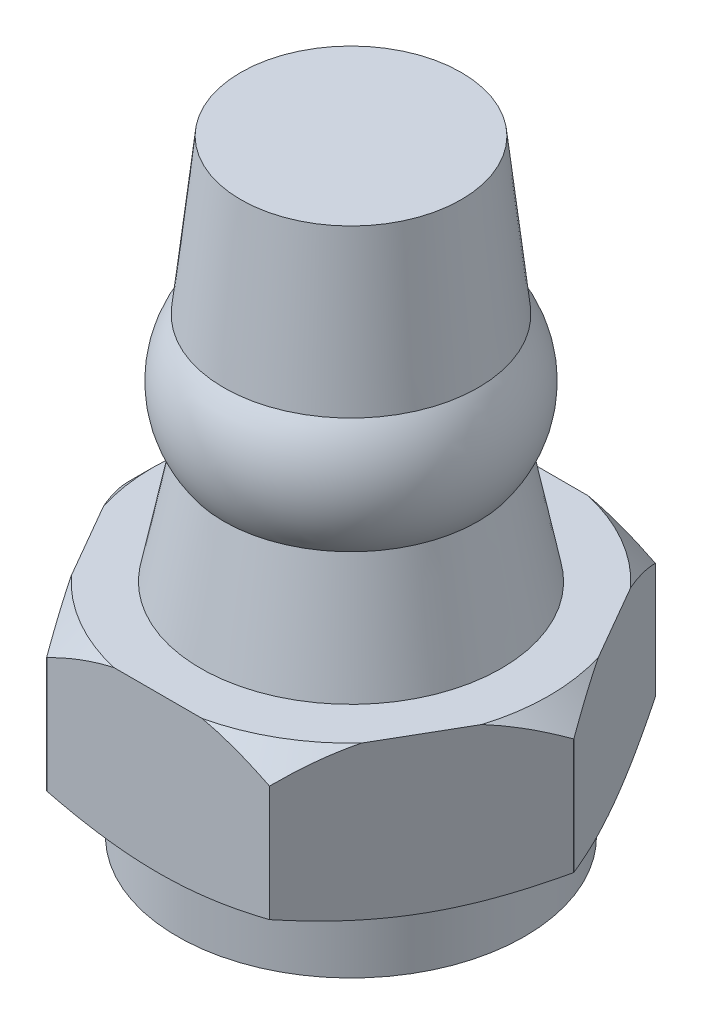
from build123d import *

# Parameters (mm, degrees)
ESQUISSE2_W                  = 6.469932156
ESQUISSE2_H                  = 4.386058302
ENL_V_MAT_EXTRU_1_DEPTH      = 10
R_P_TITION_CIRCULAIRE1_COUNT = 6


with BuildPart() as part:
    # Esquisse1 → R_volution1 (revolve)
    with BuildSketch(Plane.XY, mode=Mode.PRIVATE) as r_volution1_sk:
        with BuildLine():
            Line((0, 11), (0, 0))
            Line((0, 0), (3.15, 0))
            Line((3.15, 0), (3.15, 1))
            Line((3.15, 1), (4.04, 1.45))
            Line((4.04, 1.45), (4.04, 3.55))
            Line((4.04, 3.55), (3.59, 4))
            Line((3.59, 4), (2.727272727, 4))
            Line((2.727272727, 4), (2.307692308, 6.1))
            ThreePointArc((2.307692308, 6.1), (2.645673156, 7.15), (2.307692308, 8.2))
            Line((2.307692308, 8.2), (2, 11))
            Line((2, 11), (0, 11))
        make_face()
    revolve(r_volution1_sk.sketch.rotate(Axis((0, 11, 0), (0, -1, 0)), 180), axis=Axis((0, 11, 0), (0, -1, 0)))

    # Esquisse2 → Enl_v. mat.-Extru.1 (cut)
    with BuildSketch(Plane.XY.offset(3.5)):
        with Locations((0, 2.701655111)):
            Rectangle(ESQUISSE2_W, ESQUISSE2_H)
    enl_v_mat_extru_1 = extrude(amount=ENL_V_MAT_EXTRU_1_DEPTH, mode=Mode.SUBTRACT)

    # R_p_tition circulaire1: Enl_v. mat.-Extru.1 ×6 about axis
    r_p_tition_circulaire1_axis = Axis((0, 0, 0), (0, 1, 0))
    for i in range(1, R_P_TITION_CIRCULAIRE1_COUNT):
        add(enl_v_mat_extru_1.rotate(r_p_tition_circulaire1_axis, i * 360 / R_P_TITION_CIRCULAIRE1_COUNT), mode=Mode.SUBTRACT)


solid = part.part
